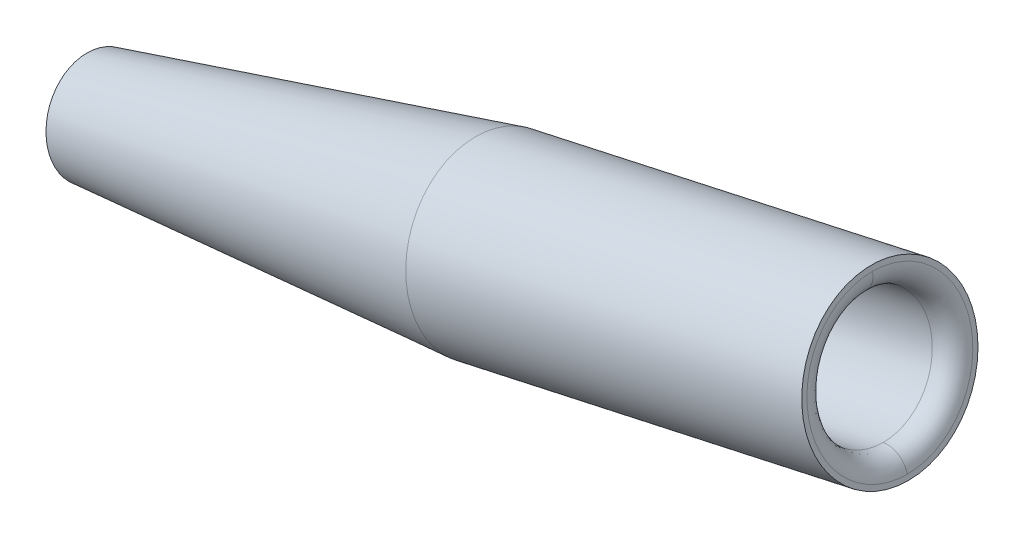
ISO-10303-21;
HEADER;
FILE_DESCRIPTION(('STEP AP214'),'2;1');
FILE_NAME('part.step','',(''),(''),'','','');
FILE_SCHEMA(('AUTOMOTIVE_DESIGN { 1 0 10303 214 1 1 1 1 }'));
ENDSEC;
DATA;
#1=APPLICATION_CONTEXT('core data for automotive mechanical design processes');
#2=APPLICATION_PROTOCOL_DEFINITION('international standard','automotive_design',2000,#1);
#3=PRODUCT_CONTEXT('',#1,'mechanical');
#4=PRODUCT('Part','Part','',(#3));
#5=PRODUCT_RELATED_PRODUCT_CATEGORY('part','',(#4));
#6=PRODUCT_DEFINITION_FORMATION('','',#4);
#7=PRODUCT_DEFINITION_CONTEXT('part definition',#1,'design');
#8=PRODUCT_DEFINITION('design','',#6,#7);
#9=PRODUCT_DEFINITION_SHAPE('','',#8);
#10=(LENGTH_UNIT() NAMED_UNIT(*) SI_UNIT(.MILLI.,.METRE.));
#11=(NAMED_UNIT(*) PLANE_ANGLE_UNIT() SI_UNIT($,.RADIAN.));
#12=(NAMED_UNIT(*) SI_UNIT($,.STERADIAN.) SOLID_ANGLE_UNIT());
#13=UNCERTAINTY_MEASURE_WITH_UNIT(LENGTH_MEASURE(1.E-05),#10,'distance_accuracy_value','');
#14=(GEOMETRIC_REPRESENTATION_CONTEXT(3) GLOBAL_UNCERTAINTY_ASSIGNED_CONTEXT((#13)) GLOBAL_UNIT_ASSIGNED_CONTEXT((#10,
#11,#12)) REPRESENTATION_CONTEXT('',''));
#15=CARTESIAN_POINT('',(0.,0.,0.));
#16=DIRECTION('',(0.,0.,1.));
#17=DIRECTION('',(1.,0.,0.));
#18=AXIS2_PLACEMENT_3D('',#15,#16,#17);
#19=CARTESIAN_POINT('',(-48.7278018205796,-8.37720855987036,-13.51));
#20=DIRECTION('',(-0.976717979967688,-0.214527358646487,0.));
#21=DIRECTION('',(0.214527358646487,-0.976717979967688,0.));
#22=AXIS2_PLACEMENT_3D('',#19,#20,#21);
#23=CYLINDRICAL_SURFACE('',#22,0.299999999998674);
#24=CARTESIAN_POINT('',(-51.6579615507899,-9.02079190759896,-13.51));
#25=DIRECTION('',(-0.976717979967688,-0.214527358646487,0.));
#26=DIRECTION('',(0.214527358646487,-0.976717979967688,0.));
#27=AXIS2_PLACEMENT_3D('',#24,#25,#26);
#28=CIRCLE('',#27,0.299999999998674);
#29=CARTESIAN_POINT('',(-51.5936033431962,-9.31380730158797,-13.51));
#30=VERTEX_POINT('',#29);
#31=EDGE_CURVE('E21',#30,#30,#28,.T.);
#32=ORIENTED_EDGE('',*,*,#31,.T.);
#33=EDGE_LOOP('',(#32));
#34=FACE_BOUND('',#33,.T.);
#35=CARTESIAN_POINT('',(-48.7278015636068,-8.377208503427,-13.51));
#36=DIRECTION('',(0.976717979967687,0.214527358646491,0.));
#37=DIRECTION('',(-0.214527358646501,0.976717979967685,0.));
#38=AXIS2_PLACEMENT_3D('',#35,#36,#37);
#39=CIRCLE('',#38,0.299998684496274);
#40=CARTESIAN_POINT('',(-48.7921594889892,-8.08419439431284,-13.51));
#41=VERTEX_POINT('',#40);
#42=EDGE_CURVE('E95',#41,#41,#39,.T.);
#43=ORIENTED_EDGE('',*,*,#42,.T.);
#44=EDGE_LOOP('',(#43));
#45=FACE_BOUND('',#44,.T.);
#46=ADVANCED_FACE('F16',(#34,#45),#23,.F.);
#47=CARTESIAN_POINT('',(-48.7278015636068,-8.377208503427,-13.51));
#48=DIRECTION('',(0.976717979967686,0.2145273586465,0.));
#49=DIRECTION('',(-0.2145273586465,0.976717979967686,0.));
#50=AXIS2_PLACEMENT_3D('',#47,#48,#49);
#51=CONICAL_SURFACE('',#50,0.299998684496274,0.19739392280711);
#52=ORIENTED_EDGE('',*,*,#42,.F.);
#53=EDGE_LOOP('',(#52));
#54=FACE_BOUND('',#53,.T.);
#55=CARTESIAN_POINT('',(-47.7510892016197,-8.16268237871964,-13.51));
#56=DIRECTION('',(0.976717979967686,0.2145273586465,0.));
#57=DIRECTION('',(-0.2145273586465,0.976717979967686,0.));
#58=AXIS2_PLACEMENT_3D('',#55,#56,#57);
#59=CIRCLE('',#58,0.499995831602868);
#60=CARTESIAN_POINT('',(-47.8583519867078,-7.67432746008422,-13.51));
#61=VERTEX_POINT('',#60);
#62=EDGE_CURVE('E124',#61,#61,#59,.T.);
#63=ORIENTED_EDGE('',*,*,#62,.T.);
#64=EDGE_LOOP('',(#63));
#65=FACE_BOUND('',#64,.T.);
#66=ADVANCED_FACE('F137',(#54,#65),#51,.F.);
#67=CARTESIAN_POINT('',(-51.76965451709,-8.512266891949,-12.99));
#68=DIRECTION('',(-0.976717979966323,-0.214527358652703,0.));
#69=DIRECTION('',(0.,0.,-1.));
#70=AXIS2_PLACEMENT_3D('',#67,#68,#69);
#71=PLANE('',#70);
#72=ORIENTED_EDGE('',*,*,#31,.F.);
#73=EDGE_LOOP('',(#72));
#74=FACE_BOUND('',#73,.T.);
#75=CARTESIAN_POINT('',(-51.6579613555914,-9.02079186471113,-13.51));
#76=DIRECTION('',(0.976717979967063,0.214527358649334,0.));
#77=DIRECTION('',(-0.214527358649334,0.976717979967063,0.));
#78=AXIS2_PLACEMENT_3D('',#75,#76,#77);
#79=CIRCLE('',#78,0.499997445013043);
#80=CARTESIAN_POINT('',(-51.7652244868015,-8.5324353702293,-13.51));
#81=VERTEX_POINT('',#80);
#82=EDGE_CURVE('E122',#81,#81,#79,.F.);
#83=ORIENTED_EDGE('',*,*,#82,.T.);
#84=EDGE_LOOP('',(#83));
#85=FACE_BOUND('',#84,.T.);
#86=ADVANCED_FACE('F133',(#74,#85),#71,.T.);
#87=CARTESIAN_POINT('',(-47.61722455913,-8.772154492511,-14.13498905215));
#88=DIRECTION('',(0.97671797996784,0.214527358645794,0.));
#89=DIRECTION('',(-0.214527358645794,0.97671797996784,0.));
#90=AXIS2_PLACEMENT_3D('',#87,#88,#89);
#91=PLANE('',#90);
#92=ORIENTED_EDGE('',*,*,#62,.F.);
#93=EDGE_LOOP('',(#92));
#94=FACE_BOUND('',#93,.T.);
#95=CARTESIAN_POINT('',(-47.7510896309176,-8.16268247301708,-13.51));
#96=DIRECTION('',(0.976717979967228,0.214527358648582,0.));
#97=DIRECTION('',(-0.214527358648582,0.976717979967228,0.));
#98=AXIS2_PLACEMENT_3D('',#95,#96,#97);
#99=CIRCLE('',#98,0.600000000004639);
#100=CARTESIAN_POINT('',(-47.8798060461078,-7.57665168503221,-13.51));
#101=VERTEX_POINT('',#100);
#102=EDGE_CURVE('E94',#101,#101,#99,.T.);
#103=ORIENTED_EDGE('',*,*,#102,.T.);
#104=EDGE_LOOP('',(#103));
#105=FACE_BOUND('',#104,.T.);
#106=ADVANCED_FACE('F136',(#94,#105),#91,.T.);
#107=CARTESIAN_POINT('',(-51.6579613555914,-9.02079186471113,-13.51));
#108=DIRECTION('',(0.976717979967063,0.214527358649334,0.));
#109=DIRECTION('',(-0.214527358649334,0.976717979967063,0.));
#110=AXIS2_PLACEMENT_3D('',#107,#108,#109);
#111=CONICAL_SURFACE('',#110,0.499997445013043,0.0872772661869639);
#112=CARTESIAN_POINT('',(-47.7510844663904,-8.16268133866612,-13.51));
#113=DIRECTION('',(-0.976717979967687,-0.214527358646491,0.));
#114=DIRECTION('',(2.44902137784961E-13,-1.10205962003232E-12,-1.));
#115=AXIS2_PLACEMENT_3D('',#112,#113,#114);
#116=CIRCLE('',#115,0.85);
#117=CARTESIAN_POINT('',(-47.7510844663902,-8.16268133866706,-14.36));
#118=VERTEX_POINT('',#117);
#119=EDGE_CURVE('E49',#118,#118,#116,.T.);
#120=ORIENTED_EDGE('',*,*,#119,.T.);
#121=EDGE_LOOP('',(#120));
#122=FACE_BOUND('',#121,.T.);
#123=ORIENTED_EDGE('',*,*,#82,.F.);
#124=EDGE_LOOP('',(#123));
#125=FACE_BOUND('',#124,.T.);
#126=ADVANCED_FACE('F141',(#122,#125),#111,.T.);
#127=CARTESIAN_POINT('',(-47.7510896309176,-8.16268247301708,-13.51));
#128=DIRECTION('',(0.976717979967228,0.214527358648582,0.));
#129=DIRECTION('',(-0.214527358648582,0.976717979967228,0.));
#130=AXIS2_PLACEMENT_3D('',#127,#128,#129);
#131=CYLINDRICAL_SURFACE('',#130,0.600000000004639);
#132=ORIENTED_EDGE('',*,*,#102,.F.);
#133=EDGE_LOOP('',(#132));
#134=FACE_BOUND('',#133,.T.);
#135=CARTESIAN_POINT('',(-44.0395613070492,-7.34747851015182,-13.51));
#136=DIRECTION('',(0.976717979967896,0.21452735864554,0.));
#137=DIRECTION('',(-0.214428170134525,0.976266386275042,0.0304056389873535));
#138=AXIS2_PLACEMENT_3D('',#135,#136,#137);
#139=CIRCLE('',#138,0.599999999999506);
#140=CARTESIAN_POINT('',(-43.9108448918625,-7.93350929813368,-13.5100000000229));
#141=VERTEX_POINT('',#140);
#142=CARTESIAN_POINT('',(-44.1682777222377,-6.76144772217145,-13.5099999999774));
#143=VERTEX_POINT('',#142);
#144=EDGE_CURVE('E43',#141,#143,#139,.T.);
#145=ORIENTED_EDGE('',*,*,#144,.T.);
#146=CARTESIAN_POINT('',(-44.0395613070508,-7.34747851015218,-13.51));
#147=DIRECTION('',(0.976717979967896,0.21452735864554,0.));
#148=DIRECTION('',(0.214428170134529,-0.976266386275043,-0.0304056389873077));
#149=AXIS2_PLACEMENT_3D('',#146,#147,#148);
#150=CIRCLE('',#149,0.600000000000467);
#151=EDGE_CURVE('E48',#143,#141,#150,.T.);
#152=ORIENTED_EDGE('',*,*,#151,.T.);
#153=EDGE_LOOP('',(#145,#152));
#154=FACE_BOUND('',#153,.T.);
#155=ADVANCED_FACE('F47',(#134,#154),#131,.F.);
#156=CARTESIAN_POINT('',(-43.84421771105,-7.304573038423,-13.51));
#157=DIRECTION('',(-0.976717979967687,-0.214527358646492,0.));
#158=DIRECTION('',(0.214527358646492,-0.976717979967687,0.));
#159=AXIS2_PLACEMENT_3D('',#156,#157,#158);
#160=CYLINDRICAL_SURFACE('',#159,0.850000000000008);
#161=CARTESIAN_POINT('',(-43.84421771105,-7.304573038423,-13.51));
#162=DIRECTION('',(-0.976717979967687,-0.214527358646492,0.));
#163=DIRECTION('',(0.214527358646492,-0.976717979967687,0.));
#164=AXIS2_PLACEMENT_3D('',#161,#162,#163);
#165=CIRCLE('',#164,0.850000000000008);
#166=CARTESIAN_POINT('',(-43.6618694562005,-8.13478332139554,-13.51));
#167=VERTEX_POINT('',#166);
#168=EDGE_CURVE('E112',#167,#167,#165,.T.);
#169=ORIENTED_EDGE('',*,*,#168,.T.);
#170=EDGE_LOOP('',(#169));
#171=FACE_BOUND('',#170,.T.);
#172=ORIENTED_EDGE('',*,*,#119,.F.);
#173=EDGE_LOOP('',(#172));
#174=FACE_BOUND('',#173,.T.);
#175=ADVANCED_FACE('F76',(#171,#174),#160,.T.);
#176=CARTESIAN_POINT('',(-44.0181542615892,-6.51383113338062,-13.485370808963));
#177=CARTESIAN_POINT('',(-43.9848224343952,-6.63599850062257,-13.4892181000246));
#178=CARTESIAN_POINT('',(-44.0531114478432,-6.74267497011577,-13.4919419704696));
#179=CARTESIAN_POINT('',(-44.1780587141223,-6.7636230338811,-13.4917489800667));
#180=(BOUNDED_CURVE() B_SPLINE_CURVE(3,(#176,#177,#178,#179),.UNSPECIFIED.,.F.,
.F.) B_SPLINE_CURVE_WITH_KNOTS((4,4),(0.,1.),
.UNSPECIFIED.) CURVE() GEOMETRIC_REPRESENTATION_ITEM() RATIONAL_B_SPLINE_CURVE((1.,
0.780527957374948,0.780527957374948,1.)) REPRESENTATION_ITEM(''));
#181=CARTESIAN_POINT('',(-44.03956130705,-7.347478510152,-13.51));
#182=DIRECTION('',(0.976717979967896,0.21452735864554,0.));
#183=AXIS1_PLACEMENT('',#181,#182);
#184=SURFACE_OF_REVOLUTION('',#180,#183);
#185=ORIENTED_EDGE('',*,*,#144,.F.);
#186=CARTESIAN_POINT('',(-43.8679394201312,-8.12885289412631,-13.5100000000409));
#187=DIRECTION('',(-1.11465370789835E-11,5.04309242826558E-11,-1.));
#188=DIRECTION('',(0.,1.,5.04309242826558E-11));
#189=AXIS2_PLACEMENT_3D('',#186,#187,#188);
#190=CIRCLE('',#189,0.200000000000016);
#191=CARTESIAN_POINT('',(-43.6725958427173,-8.08594733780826,-13.5100000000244));
#192=VERTEX_POINT('',#191);
#193=EDGE_CURVE('E52',#141,#192,#190,.T.);
#194=ORIENTED_EDGE('',*,*,#193,.T.);
#195=CARTESIAN_POINT('',(-43.8442177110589,-7.30457303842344,-13.51));
#196=DIRECTION('',(0.976717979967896,0.21452735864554,0.));
#197=DIRECTION('',(0.214527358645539,-0.976717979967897,-4.99925660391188E-11));
#198=AXIS2_PLACEMENT_3D('',#195,#196,#197);
#199=CIRCLE('',#198,0.799999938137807);
#200=CARTESIAN_POINT('',(-44.0158395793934,-6.52319873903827,-13.5099999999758));
#201=VERTEX_POINT('',#200);
#202=EDGE_CURVE('E27',#192,#201,#199,.T.);
#203=ORIENTED_EDGE('',*,*,#202,.T.);
#204=CARTESIAN_POINT('',(-44.2111831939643,-6.5661041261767,-13.50999999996));
#205=DIRECTION('',(-1.0797903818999E-11,4.93409381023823E-11,-1.));
#206=DIRECTION('',(0.,1.,4.93409381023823E-11));
#207=AXIS2_PLACEMENT_3D('',#204,#205,#206);
#208=CIRCLE('',#207,0.200000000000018);
#209=EDGE_CURVE('E34',#201,#143,#208,.T.);
#210=ORIENTED_EDGE('',*,*,#209,.T.);
#211=EDGE_LOOP('',(#185,#194,#203,#210));
#212=FACE_BOUND('',#211,.T.);
#213=ADVANCED_FACE('F55',(#212),#184,.T.);
#214=CARTESIAN_POINT('',(-43.6707718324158,-8.09542271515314,-13.534629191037));
#215=CARTESIAN_POINT('',(-43.6917041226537,-7.97053190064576,-13.5307818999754));
#216=CARTESIAN_POINT('',(-43.7984119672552,-7.90229192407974,-13.5280580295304));
#217=CARTESIAN_POINT('',(-43.9206372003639,-7.93563308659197,-13.5282510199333));
#218=(BOUNDED_CURVE() B_SPLINE_CURVE(3,(#214,#215,#216,#217),.UNSPECIFIED.,.F.,
.F.) B_SPLINE_CURVE_WITH_KNOTS((4,4),(0.,1.),
.UNSPECIFIED.) CURVE() GEOMETRIC_REPRESENTATION_ITEM() RATIONAL_B_SPLINE_CURVE((1.,
0.780527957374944,0.780527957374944,1.)) REPRESENTATION_ITEM(''));
#219=CARTESIAN_POINT('',(-44.03956130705,-7.347478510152,-13.51));
#220=DIRECTION('',(0.976717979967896,0.21452735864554,0.));
#221=AXIS1_PLACEMENT('',#219,#220);
#222=SURFACE_OF_REVOLUTION('',#218,#221);
#223=ORIENTED_EDGE('',*,*,#151,.F.);
#224=ORIENTED_EDGE('',*,*,#209,.F.);
#225=CARTESIAN_POINT('',(-43.8442177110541,-7.30457303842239,-13.51));
#226=DIRECTION('',(0.976717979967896,0.21452735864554,0.));
#227=DIRECTION('',(-0.214527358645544,0.976717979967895,4.99990712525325E-11));
#228=AXIS2_PLACEMENT_3D('',#225,#226,#227);
#229=CIRCLE('',#228,0.799999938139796);
#230=EDGE_CURVE('E11',#201,#192,#229,.T.);
#231=ORIENTED_EDGE('',*,*,#230,.T.);
#232=ORIENTED_EDGE('',*,*,#193,.F.);
#233=EDGE_LOOP('',(#223,#224,#231,#232));
#234=FACE_BOUND('',#233,.T.);
#235=ADVANCED_FACE('F51',(#234),#222,.T.);
#236=CARTESIAN_POINT('',(-44.0338598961,-6.441154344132,-12.626));
#237=DIRECTION('',(-0.976717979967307,-0.214527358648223,0.));
#238=DIRECTION('',(0.,0.,-1.));
#239=AXIS2_PLACEMENT_3D('',#236,#237,#238);
#240=PLANE('',#239);
#241=ORIENTED_EDGE('',*,*,#202,.F.);
#242=ORIENTED_EDGE('',*,*,#230,.F.);
#243=EDGE_LOOP('',(#241,#242));
#244=FACE_BOUND('',#243,.T.);
#245=ORIENTED_EDGE('',*,*,#168,.F.);
#246=EDGE_LOOP('',(#245));
#247=FACE_BOUND('',#246,.T.);
#248=ADVANCED_FACE('F18',(#244,#247),#240,.F.);
#249=CLOSED_SHELL('',(#46,#66,#86,#106,#126,#155,#175,#213,#235,#248));
#250=MANIFOLD_SOLID_BREP('B1',#249);
#251=ADVANCED_BREP_SHAPE_REPRESENTATION('',(#18,#250),#14);
#252=SHAPE_DEFINITION_REPRESENTATION(#9,#251);
ENDSEC;
END-ISO-10303-21;
